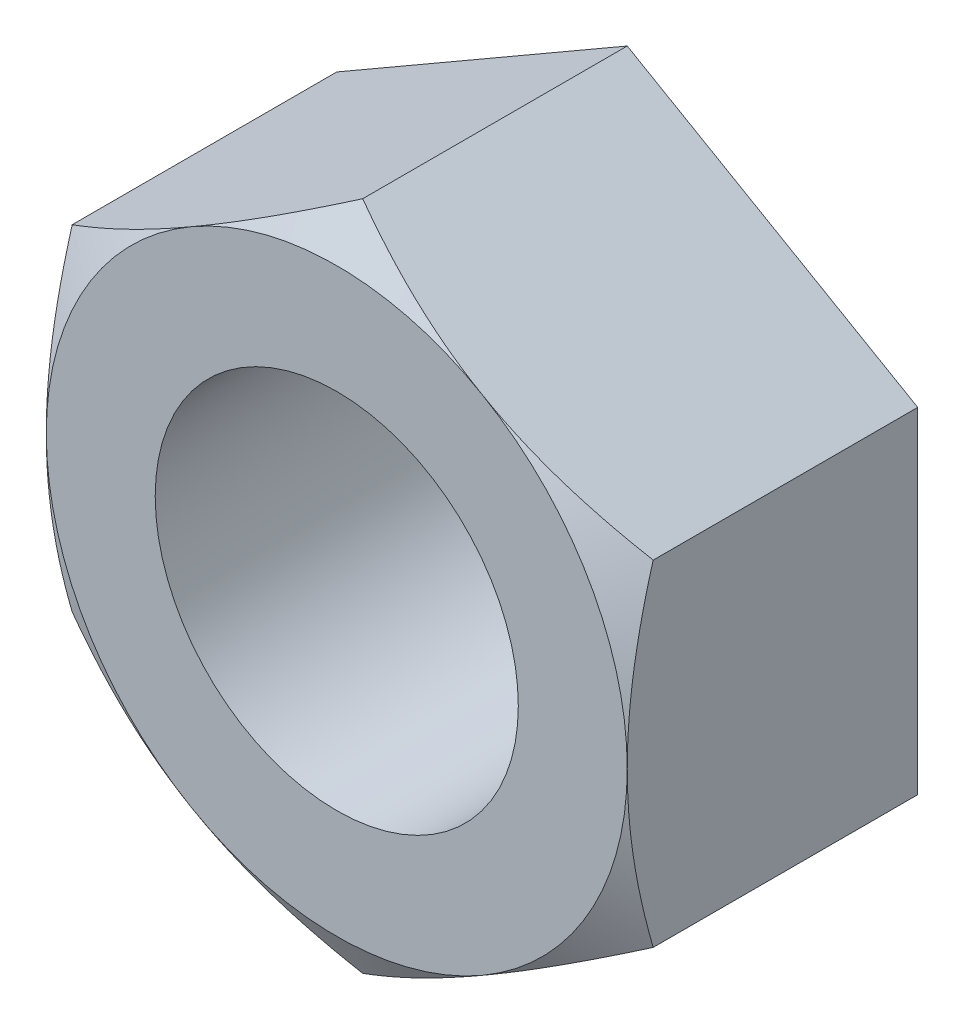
ISO-10303-21;
HEADER;
FILE_DESCRIPTION(('STEP AP214'),'2;1');
FILE_NAME('part.step','',(''),(''),'','','');
FILE_SCHEMA(('AUTOMOTIVE_DESIGN { 1 0 10303 214 1 1 1 1 }'));
ENDSEC;
DATA;
#1=APPLICATION_CONTEXT('core data for automotive mechanical design processes');
#2=APPLICATION_PROTOCOL_DEFINITION('international standard','automotive_design',2000,#1);
#3=PRODUCT_CONTEXT('',#1,'mechanical');
#4=PRODUCT('Part','Part','',(#3));
#5=PRODUCT_RELATED_PRODUCT_CATEGORY('part','',(#4));
#6=PRODUCT_DEFINITION_FORMATION('','',#4);
#7=PRODUCT_DEFINITION_CONTEXT('part definition',#1,'design');
#8=PRODUCT_DEFINITION('design','',#6,#7);
#9=PRODUCT_DEFINITION_SHAPE('','',#8);
#10=(LENGTH_UNIT() NAMED_UNIT(*) SI_UNIT(.MILLI.,.METRE.));
#11=(NAMED_UNIT(*) PLANE_ANGLE_UNIT() SI_UNIT($,.RADIAN.));
#12=(NAMED_UNIT(*) SI_UNIT($,.STERADIAN.) SOLID_ANGLE_UNIT());
#13=UNCERTAINTY_MEASURE_WITH_UNIT(LENGTH_MEASURE(1.E-05),#10,'distance_accuracy_value','');
#14=(GEOMETRIC_REPRESENTATION_CONTEXT(3) GLOBAL_UNCERTAINTY_ASSIGNED_CONTEXT((#13)) GLOBAL_UNIT_ASSIGNED_CONTEXT((#10,
#11,#12)) REPRESENTATION_CONTEXT('',''));
#15=CARTESIAN_POINT('',(0.,0.,0.));
#16=DIRECTION('',(0.,0.,1.));
#17=DIRECTION('',(1.,0.,0.));
#18=AXIS2_PLACEMENT_3D('',#15,#16,#17);
#19=CARTESIAN_POINT('',(4.,2.30940107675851,4.));
#20=DIRECTION('',(-0.5,-0.866025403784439,0.));
#21=DIRECTION('',(0.866025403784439,-0.5,0.));
#22=AXIS2_PLACEMENT_3D('',#19,#20,#21);
#23=PLANE('',#22);
#24=CARTESIAN_POINT('',(4.00000000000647,2.30940107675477,3.64273441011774));
#25=CARTESIAN_POINT('',(3.83720085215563,2.4033932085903,3.6970144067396));
#26=CARTESIAN_POINT('',(3.67309795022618,2.49813806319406,3.74674436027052));
#27=CARTESIAN_POINT('',(3.34344559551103,2.68846293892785,3.83444223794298));
#28=CARTESIAN_POINT('',(3.17790764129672,2.78403632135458,3.87246832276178));
#29=CARTESIAN_POINT('',(2.92803843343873,2.92829837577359,3.91915789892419));
#30=CARTESIAN_POINT('',(2.84443305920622,2.97656796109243,3.93300183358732));
#31=CARTESIAN_POINT('',(2.67682205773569,3.07333821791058,3.95696597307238));
#32=CARTESIAN_POINT('',(2.59281644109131,3.12183888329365,3.96708627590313));
#33=CARTESIAN_POINT('',(2.42409422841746,3.21925069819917,3.98342533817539));
#34=CARTESIAN_POINT('',(2.3393761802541,3.2681626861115,3.98962425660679));
#35=CARTESIAN_POINT('',(2.16977347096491,3.36608285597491,3.99792016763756));
#36=CARTESIAN_POINT('',(2.08488878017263,3.41509105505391,4.00001634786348));
#37=CARTESIAN_POINT('',(2.,3.46410161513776,4.00000000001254));
#38=B_SPLINE_CURVE_WITH_KNOTS('',3,(#24,#25,#26,#27,#28,#29,#30,#31,#32,#33,#34,#35,#36,#37),
.UNSPECIFIED.,.F.,.F.,(4,2,2,2,2,2,4),(0.,0.587229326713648,1.17149154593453,1.46400599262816,
1.75651273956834,2.05048788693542,2.34452123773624),.UNSPECIFIED.);
#39=CARTESIAN_POINT('',(4.,2.30940107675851,3.64273441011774));
#40=VERTEX_POINT('',#39);
#41=CARTESIAN_POINT('',(2.00000000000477,3.46410161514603,4.00000000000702));
#42=VERTEX_POINT('',#41);
#43=EDGE_CURVE('E289',#40,#42,#38,.T.);
#44=ORIENTED_EDGE('',*,*,#43,.F.);
#45=DIRECTION('',(0.,0.,1.));
#46=VECTOR('',#45,1.);
#47=CARTESIAN_POINT('',(4.,2.30940107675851,0.));
#48=LINE('',#47,#46);
#49=CARTESIAN_POINT('',(4.,2.30940107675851,0.));
#50=VERTEX_POINT('',#49);
#51=EDGE_CURVE('E129',#50,#40,#48,.T.);
#52=ORIENTED_EDGE('',*,*,#51,.F.);
#53=DIRECTION('',(0.866025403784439,-0.5,0.));
#54=VECTOR('',#53,1.);
#55=CARTESIAN_POINT('',(4.,2.30940107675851,0.));
#56=LINE('',#55,#54);
#57=CARTESIAN_POINT('',(0.,4.61880215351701,0.));
#58=VERTEX_POINT('',#57);
#59=EDGE_CURVE('E122',#58,#50,#56,.T.);
#60=ORIENTED_EDGE('',*,*,#59,.F.);
#61=DIRECTION('',(0.,0.,1.));
#62=VECTOR('',#61,1.);
#63=CARTESIAN_POINT('',(0.,4.61880215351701,0.));
#64=LINE('',#63,#62);
#65=CARTESIAN_POINT('',(0.,4.61880215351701,3.64273441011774));
#66=VERTEX_POINT('',#65);
#67=EDGE_CURVE('E127',#58,#66,#64,.T.);
#68=ORIENTED_EDGE('',*,*,#67,.T.);
#69=CARTESIAN_POINT('',(2.,3.46410161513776,4.00000000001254));
#70=CARTESIAN_POINT('',(1.91511121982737,3.51311217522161,4.00001634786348));
#71=CARTESIAN_POINT('',(1.8302265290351,3.5621203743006,3.99792016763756));
#72=CARTESIAN_POINT('',(1.6606238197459,3.66004054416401,3.98962425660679));
#73=CARTESIAN_POINT('',(1.57590577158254,3.70895253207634,3.98342533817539));
#74=CARTESIAN_POINT('',(1.40718355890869,3.80636434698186,3.96708627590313));
#75=CARTESIAN_POINT('',(1.32317794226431,3.85486501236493,3.95696597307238));
#76=CARTESIAN_POINT('',(1.15556694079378,3.95163526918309,3.93300183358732));
#77=CARTESIAN_POINT('',(1.07196156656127,3.99990485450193,3.91915789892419));
#78=CARTESIAN_POINT('',(0.822092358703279,4.14416690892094,3.87246832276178));
#79=CARTESIAN_POINT('',(0.656554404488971,4.23974029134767,3.83444223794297));
#80=CARTESIAN_POINT('',(0.326902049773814,4.43006516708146,3.74674436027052));
#81=CARTESIAN_POINT('',(0.16279914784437,4.52481002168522,3.6970144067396));
#82=CARTESIAN_POINT('',(-6.47505238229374E-12,4.61880215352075,3.64273441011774));
#83=B_SPLINE_CURVE_WITH_KNOTS('',3,(#69,#70,#71,#72,#73,#74,#75,#76,#77,#78,#79,#80,#81,#82),
.UNSPECIFIED.,.F.,.F.,(4,2,2,2,2,2,4),(0.,0.294033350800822,0.588008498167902,0.880515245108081,
1.17302969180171,1.75729191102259,2.34452123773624),.UNSPECIFIED.);
#84=EDGE_CURVE('E229',#42,#66,#83,.T.);
#85=ORIENTED_EDGE('',*,*,#84,.F.);
#86=EDGE_LOOP('',(#44,#52,#60,#68,#85));
#87=FACE_BOUND('',#86,.T.);
#88=ADVANCED_FACE('F37',(#87),#23,.F.);
#89=CARTESIAN_POINT('',(4.,-2.3094010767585,4.));
#90=DIRECTION('',(-1.,0.,0.));
#91=DIRECTION('',(0.,0.,1.));
#92=AXIS2_PLACEMENT_3D('',#89,#90,#91);
#93=PLANE('',#92);
#94=CARTESIAN_POINT('',(4.,-2.30940107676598,3.64273441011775));
#95=CARTESIAN_POINT('',(4.,-2.12141681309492,3.6970144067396));
#96=CARTESIAN_POINT('',(4.,-1.9319271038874,3.74674436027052));
#97=CARTESIAN_POINT('',(4.,-1.55127735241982,3.83444223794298));
#98=CARTESIAN_POINT('',(4.,-1.36013058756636,3.87246832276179));
#99=CARTESIAN_POINT('',(4.,-1.07160647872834,3.91915789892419));
#100=CARTESIAN_POINT('',(4.,-0.975067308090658,3.93300183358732));
#101=CARTESIAN_POINT('',(4.,-0.781526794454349,3.95696597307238));
#102=CARTESIAN_POINT('',(4.,-0.684525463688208,3.96708627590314));
#103=CARTESIAN_POINT('',(4.,-0.48970183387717,3.98342533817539));
#104=CARTESIAN_POINT('',(4.,-0.391877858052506,3.9896242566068));
#105=CARTESIAN_POINT('',(4.,-0.19603751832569,3.99792016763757));
#106=CARTESIAN_POINT('',(4.,-0.0980211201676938,4.00001634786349));
#107=CARTESIAN_POINT('',(4.,0.,4.00000000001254));
#108=B_SPLINE_CURVE_WITH_KNOTS('',3,(#94,#95,#96,#97,#98,#99,#100,#101,#102,#103,#104,#105,#106,
#107),.UNSPECIFIED.,.F.,.F.,(4,2,2,2,2,2,4),(0.,0.587229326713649,1.17149154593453,
1.46400599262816,1.75651273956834,2.05048788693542,2.34452123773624),.UNSPECIFIED.);
#109=CARTESIAN_POINT('',(4.,-2.3094010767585,3.64273441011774));
#110=VERTEX_POINT('',#109);
#111=CARTESIAN_POINT('',(4.00000000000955,0.,4.00000000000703));
#112=VERTEX_POINT('',#111);
#113=EDGE_CURVE('E326',#110,#112,#108,.T.);
#114=ORIENTED_EDGE('',*,*,#113,.F.);
#115=DIRECTION('',(0.,0.,1.));
#116=VECTOR('',#115,1.);
#117=CARTESIAN_POINT('',(4.,-2.3094010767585,0.));
#118=LINE('',#117,#116);
#119=CARTESIAN_POINT('',(4.,-2.3094010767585,0.));
#120=VERTEX_POINT('',#119);
#121=EDGE_CURVE('E150',#120,#110,#118,.T.);
#122=ORIENTED_EDGE('',*,*,#121,.F.);
#123=DIRECTION('',(0.,-1.,0.));
#124=VECTOR('',#123,1.);
#125=CARTESIAN_POINT('',(4.,-2.3094010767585,0.));
#126=LINE('',#125,#124);
#127=EDGE_CURVE('E132',#50,#120,#126,.T.);
#128=ORIENTED_EDGE('',*,*,#127,.F.);
#129=ORIENTED_EDGE('',*,*,#51,.T.);
#130=CARTESIAN_POINT('',(4.,0.,4.00000000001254));
#131=CARTESIAN_POINT('',(4.,0.0980211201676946,4.00001634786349));
#132=CARTESIAN_POINT('',(4.,0.196037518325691,3.99792016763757));
#133=CARTESIAN_POINT('',(4.,0.391877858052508,3.9896242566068));
#134=CARTESIAN_POINT('',(4.,0.489701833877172,3.98342533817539));
#135=CARTESIAN_POINT('',(4.,0.684525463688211,3.96708627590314));
#136=CARTESIAN_POINT('',(4.,0.781526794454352,3.95696597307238));
#137=CARTESIAN_POINT('',(4.,0.975067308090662,3.93300183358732));
#138=CARTESIAN_POINT('',(4.,1.07160647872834,3.91915789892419));
#139=CARTESIAN_POINT('',(4.,1.36013058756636,3.87246832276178));
#140=CARTESIAN_POINT('',(4.,1.55127735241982,3.83444223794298));
#141=CARTESIAN_POINT('',(4.,1.9319271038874,3.74674436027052));
#142=CARTESIAN_POINT('',(4.,2.12141681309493,3.6970144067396));
#143=CARTESIAN_POINT('',(4.,2.30940107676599,3.64273441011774));
#144=B_SPLINE_CURVE_WITH_KNOTS('',3,(#130,#131,#132,#133,#134,#135,#136,#137,#138,#139,#140,
#141,#142,#143),.UNSPECIFIED.,.F.,.F.,(4,2,2,2,2,2,4),(0.,0.294033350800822,0.588008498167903,
0.880515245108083,1.17302969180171,1.7572919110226,2.34452123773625),.UNSPECIFIED.);
#145=EDGE_CURVE('E307',#112,#40,#144,.T.);
#146=ORIENTED_EDGE('',*,*,#145,.F.);
#147=EDGE_LOOP('',(#114,#122,#128,#129,#146));
#148=FACE_BOUND('',#147,.T.);
#149=ADVANCED_FACE('F311',(#148),#93,.F.);
#150=CARTESIAN_POINT('',(0.,-4.618802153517,4.));
#151=DIRECTION('',(-0.5,0.866025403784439,0.));
#152=DIRECTION('',(-0.866025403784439,-0.5,0.));
#153=AXIS2_PLACEMENT_3D('',#150,#151,#152);
#154=PLANE('',#153);
#155=CARTESIAN_POINT('',(-6.47531300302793E-12,-4.61880215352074,3.64273441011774));
#156=CARTESIAN_POINT('',(0.162799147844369,-4.52481002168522,3.6970144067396));
#157=CARTESIAN_POINT('',(0.326902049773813,-4.43006516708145,3.74674436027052));
#158=CARTESIAN_POINT('',(0.656554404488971,-4.23974029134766,3.83444223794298));
#159=CARTESIAN_POINT('',(0.822092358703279,-4.14416690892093,3.87246832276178));
#160=CARTESIAN_POINT('',(1.07196156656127,-3.99990485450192,3.91915789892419));
#161=CARTESIAN_POINT('',(1.15556694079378,-3.95163526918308,3.93300183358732));
#162=CARTESIAN_POINT('',(1.32317794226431,-3.85486501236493,3.95696597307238));
#163=CARTESIAN_POINT('',(1.40718355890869,-3.80636434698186,3.96708627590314));
#164=CARTESIAN_POINT('',(1.57590577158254,-3.70895253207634,3.98342533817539));
#165=CARTESIAN_POINT('',(1.6606238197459,-3.66004054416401,3.9896242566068));
#166=CARTESIAN_POINT('',(1.8302265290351,-3.5621203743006,3.99792016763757));
#167=CARTESIAN_POINT('',(1.91511121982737,-3.5131121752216,4.00001634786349));
#168=CARTESIAN_POINT('',(2.,-3.46410161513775,4.00000000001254));
#169=B_SPLINE_CURVE_WITH_KNOTS('',3,(#155,#156,#157,#158,#159,#160,#161,#162,#163,#164,#165,
#166,#167,#168),.UNSPECIFIED.,.F.,.F.,(4,2,2,2,2,2,4),(0.,0.58722932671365,1.17149154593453,
1.46400599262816,1.75651273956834,2.05048788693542,2.34452123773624),.UNSPECIFIED.);
#170=CARTESIAN_POINT('',(0.,-4.618802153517,3.64273441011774));
#171=VERTEX_POINT('',#170);
#172=CARTESIAN_POINT('',(2.00000000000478,-3.46410161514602,4.00000000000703));
#173=VERTEX_POINT('',#172);
#174=EDGE_CURVE('E522',#171,#173,#169,.T.);
#175=ORIENTED_EDGE('',*,*,#174,.F.);
#176=DIRECTION('',(0.,0.,1.));
#177=VECTOR('',#176,1.);
#178=CARTESIAN_POINT('',(0.,-4.618802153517,0.));
#179=LINE('',#178,#177);
#180=CARTESIAN_POINT('',(0.,-4.618802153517,0.));
#181=VERTEX_POINT('',#180);
#182=EDGE_CURVE('E159',#181,#171,#179,.T.);
#183=ORIENTED_EDGE('',*,*,#182,.F.);
#184=DIRECTION('',(-0.866025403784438,-0.5,0.));
#185=VECTOR('',#184,1.);
#186=CARTESIAN_POINT('',(0.,-4.618802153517,0.));
#187=LINE('',#186,#185);
#188=EDGE_CURVE('E342',#120,#181,#187,.T.);
#189=ORIENTED_EDGE('',*,*,#188,.F.);
#190=ORIENTED_EDGE('',*,*,#121,.T.);
#191=CARTESIAN_POINT('',(2.,-3.46410161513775,4.00000000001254));
#192=CARTESIAN_POINT('',(2.08488878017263,-3.4150910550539,4.00001634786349));
#193=CARTESIAN_POINT('',(2.16977347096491,-3.36608285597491,3.99792016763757));
#194=CARTESIAN_POINT('',(2.3393761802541,-3.2681626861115,3.9896242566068));
#195=CARTESIAN_POINT('',(2.42409422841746,-3.21925069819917,3.98342533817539));
#196=CARTESIAN_POINT('',(2.59281644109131,-3.12183888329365,3.96708627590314));
#197=CARTESIAN_POINT('',(2.67682205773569,-3.07333821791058,3.95696597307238));
#198=CARTESIAN_POINT('',(2.84443305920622,-2.97656796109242,3.93300183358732));
#199=CARTESIAN_POINT('',(2.92803843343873,-2.92829837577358,3.91915789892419));
#200=CARTESIAN_POINT('',(3.17790764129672,-2.78403632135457,3.87246832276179));
#201=CARTESIAN_POINT('',(3.34344559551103,-2.68846293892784,3.83444223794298));
#202=CARTESIAN_POINT('',(3.67309795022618,-2.49813806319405,3.74674436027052));
#203=CARTESIAN_POINT('',(3.83720085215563,-2.40339320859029,3.6970144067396));
#204=CARTESIAN_POINT('',(4.00000000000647,-2.30940107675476,3.64273441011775));
#205=B_SPLINE_CURVE_WITH_KNOTS('',3,(#191,#192,#193,#194,#195,#196,#197,#198,#199,#200,#201,
#202,#203,#204),.UNSPECIFIED.,.F.,.F.,(4,2,2,2,2,2,4),(0.,0.294033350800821,0.588008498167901,
0.88051524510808,1.17302969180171,1.75729191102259,2.34452123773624),.UNSPECIFIED.);
#206=EDGE_CURVE('E291',#173,#110,#205,.T.);
#207=ORIENTED_EDGE('',*,*,#206,.F.);
#208=EDGE_LOOP('',(#175,#183,#189,#190,#207));
#209=FACE_BOUND('',#208,.T.);
#210=ADVANCED_FACE('F314',(#209),#154,.F.);
#211=CARTESIAN_POINT('',(-4.,-2.3094010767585,4.));
#212=DIRECTION('',(0.5,0.866025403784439,0.));
#213=DIRECTION('',(-0.866025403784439,0.5,0.));
#214=AXIS2_PLACEMENT_3D('',#211,#212,#213);
#215=PLANE('',#214);
#216=CARTESIAN_POINT('',(-4.00000000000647,-2.30940107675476,3.64273441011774));
#217=CARTESIAN_POINT('',(-3.83720085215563,-2.40339320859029,3.6970144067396));
#218=CARTESIAN_POINT('',(-3.67309795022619,-2.49813806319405,3.74674436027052));
#219=CARTESIAN_POINT('',(-3.34344559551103,-2.68846293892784,3.83444223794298));
#220=CARTESIAN_POINT('',(-3.17790764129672,-2.78403632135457,3.87246832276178));
#221=CARTESIAN_POINT('',(-2.92803843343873,-2.92829837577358,3.91915789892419));
#222=CARTESIAN_POINT('',(-2.84443305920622,-2.97656796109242,3.93300183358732));
#223=CARTESIAN_POINT('',(-2.67682205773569,-3.07333821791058,3.95696597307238));
#224=CARTESIAN_POINT('',(-2.59281644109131,-3.12183888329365,3.96708627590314));
#225=CARTESIAN_POINT('',(-2.42409422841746,-3.21925069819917,3.98342533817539));
#226=CARTESIAN_POINT('',(-2.3393761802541,-3.2681626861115,3.9896242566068));
#227=CARTESIAN_POINT('',(-2.1697734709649,-3.36608285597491,3.99792016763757));
#228=CARTESIAN_POINT('',(-2.08488878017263,-3.41509105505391,4.00001634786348));
#229=CARTESIAN_POINT('',(-2.,-3.46410161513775,4.00000000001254));
#230=B_SPLINE_CURVE_WITH_KNOTS('',3,(#216,#217,#218,#219,#220,#221,#222,#223,#224,#225,#226,
#227,#228,#229),.UNSPECIFIED.,.F.,.F.,(4,2,2,2,2,2,4),(0.,0.58722932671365,1.17149154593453,
1.46400599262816,1.75651273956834,2.05048788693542,2.34452123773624),.UNSPECIFIED.);
#231=CARTESIAN_POINT('',(-4.,-2.3094010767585,3.64273441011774));
#232=VERTEX_POINT('',#231);
#233=CARTESIAN_POINT('',(-2.00000000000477,-3.46410161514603,4.00000000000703));
#234=VERTEX_POINT('',#233);
#235=EDGE_CURVE('E181',#232,#234,#230,.T.);
#236=ORIENTED_EDGE('',*,*,#235,.F.);
#237=DIRECTION('',(0.,0.,1.));
#238=VECTOR('',#237,1.);
#239=CARTESIAN_POINT('',(-4.,-2.3094010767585,0.));
#240=LINE('',#239,#238);
#241=CARTESIAN_POINT('',(-4.,-2.3094010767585,0.));
#242=VERTEX_POINT('',#241);
#243=EDGE_CURVE('E164',#242,#232,#240,.T.);
#244=ORIENTED_EDGE('',*,*,#243,.F.);
#245=DIRECTION('',(-0.866025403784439,0.5,0.));
#246=VECTOR('',#245,1.);
#247=CARTESIAN_POINT('',(-4.,-2.3094010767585,0.));
#248=LINE('',#247,#246);
#249=EDGE_CURVE('E340',#181,#242,#248,.T.);
#250=ORIENTED_EDGE('',*,*,#249,.F.);
#251=ORIENTED_EDGE('',*,*,#182,.T.);
#252=CARTESIAN_POINT('',(-2.,-3.46410161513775,4.00000000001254));
#253=CARTESIAN_POINT('',(-1.91511121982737,-3.5131121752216,4.00001634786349));
#254=CARTESIAN_POINT('',(-1.83022652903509,-3.5621203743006,3.99792016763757));
#255=CARTESIAN_POINT('',(-1.6606238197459,-3.66004054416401,3.9896242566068));
#256=CARTESIAN_POINT('',(-1.57590577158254,-3.70895253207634,3.98342533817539));
#257=CARTESIAN_POINT('',(-1.40718355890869,-3.80636434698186,3.96708627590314));
#258=CARTESIAN_POINT('',(-1.32317794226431,-3.85486501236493,3.95696597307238));
#259=CARTESIAN_POINT('',(-1.15556694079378,-3.95163526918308,3.93300183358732));
#260=CARTESIAN_POINT('',(-1.07196156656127,-3.99990485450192,3.91915789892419));
#261=CARTESIAN_POINT('',(-0.822092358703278,-4.14416690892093,3.87246832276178));
#262=CARTESIAN_POINT('',(-0.65655440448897,-4.23974029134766,3.83444223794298));
#263=CARTESIAN_POINT('',(-0.326902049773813,-4.43006516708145,3.74674436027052));
#264=CARTESIAN_POINT('',(-0.162799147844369,-4.52481002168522,3.6970144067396));
#265=CARTESIAN_POINT('',(6.47543648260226E-12,-4.61880215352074,3.64273441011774));
#266=B_SPLINE_CURVE_WITH_KNOTS('',3,(#252,#253,#254,#255,#256,#257,#258,#259,#260,#261,#262,
#263,#264,#265),.UNSPECIFIED.,.F.,.F.,(4,2,2,2,2,2,4),(0.,0.294033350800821,0.588008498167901,
0.88051524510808,1.17302969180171,1.75729191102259,2.34452123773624),.UNSPECIFIED.);
#267=EDGE_CURVE('E88',#234,#171,#266,.T.);
#268=ORIENTED_EDGE('',*,*,#267,.F.);
#269=EDGE_LOOP('',(#236,#244,#250,#251,#268));
#270=FACE_BOUND('',#269,.T.);
#271=ADVANCED_FACE('F185',(#270),#215,.F.);
#272=CARTESIAN_POINT('',(-4.,2.3094010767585,4.));
#273=DIRECTION('',(1.,0.,0.));
#274=DIRECTION('',(0.,1.,0.));
#275=AXIS2_PLACEMENT_3D('',#272,#273,#274);
#276=PLANE('',#275);
#277=CARTESIAN_POINT('',(-4.,2.30940107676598,3.64273441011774));
#278=CARTESIAN_POINT('',(-4.,2.12141681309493,3.6970144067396));
#279=CARTESIAN_POINT('',(-4.,1.9319271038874,3.74674436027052));
#280=CARTESIAN_POINT('',(-4.,1.55127735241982,3.83444223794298));
#281=CARTESIAN_POINT('',(-4.,1.36013058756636,3.87246832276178));
#282=CARTESIAN_POINT('',(-4.,1.07160647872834,3.91915789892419));
#283=CARTESIAN_POINT('',(-4.,0.97506730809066,3.93300183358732));
#284=CARTESIAN_POINT('',(-4.,0.78152679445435,3.95696597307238));
#285=CARTESIAN_POINT('',(-4.,0.684525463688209,3.96708627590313));
#286=CARTESIAN_POINT('',(-4.,0.489701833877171,3.98342533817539));
#287=CARTESIAN_POINT('',(-4.,0.391877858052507,3.9896242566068));
#288=CARTESIAN_POINT('',(-4.,0.19603751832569,3.99792016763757));
#289=CARTESIAN_POINT('',(-4.,0.0980211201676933,4.00001634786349));
#290=CARTESIAN_POINT('',(-4.,0.,4.00000000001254));
#291=B_SPLINE_CURVE_WITH_KNOTS('',3,(#277,#278,#279,#280,#281,#282,#283,#284,#285,#286,#287,
#288,#289,#290),.UNSPECIFIED.,.F.,.F.,(4,2,2,2,2,2,4),(0.,0.58722932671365,1.17149154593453,
1.46400599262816,1.75651273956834,2.05048788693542,2.34452123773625),.UNSPECIFIED.);
#292=CARTESIAN_POINT('',(-4.,2.3094010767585,3.64273441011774));
#293=VERTEX_POINT('',#292);
#294=CARTESIAN_POINT('',(-4.00000000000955,0.,4.00000000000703));
#295=VERTEX_POINT('',#294);
#296=EDGE_CURVE('E227',#293,#295,#291,.T.);
#297=ORIENTED_EDGE('',*,*,#296,.F.);
#298=DIRECTION('',(0.,0.,1.));
#299=VECTOR('',#298,1.);
#300=CARTESIAN_POINT('',(-4.,2.3094010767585,0.));
#301=LINE('',#300,#299);
#302=CARTESIAN_POINT('',(-4.,2.3094010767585,0.));
#303=VERTEX_POINT('',#302);
#304=EDGE_CURVE('E169',#303,#293,#301,.T.);
#305=ORIENTED_EDGE('',*,*,#304,.F.);
#306=DIRECTION('',(0.,1.,0.));
#307=VECTOR('',#306,1.);
#308=CARTESIAN_POINT('',(-4.,2.3094010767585,0.));
#309=LINE('',#308,#307);
#310=EDGE_CURVE('E138',#242,#303,#309,.T.);
#311=ORIENTED_EDGE('',*,*,#310,.F.);
#312=ORIENTED_EDGE('',*,*,#243,.T.);
#313=CARTESIAN_POINT('',(-4.,0.,4.00000000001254));
#314=CARTESIAN_POINT('',(-4.,-0.0980211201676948,4.00001634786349));
#315=CARTESIAN_POINT('',(-4.,-0.196037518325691,3.99792016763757));
#316=CARTESIAN_POINT('',(-4.,-0.391877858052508,3.9896242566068));
#317=CARTESIAN_POINT('',(-4.,-0.489701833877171,3.98342533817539));
#318=CARTESIAN_POINT('',(-4.,-0.684525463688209,3.96708627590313));
#319=CARTESIAN_POINT('',(-4.,-0.78152679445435,3.95696597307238));
#320=CARTESIAN_POINT('',(-4.,-0.975067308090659,3.93300183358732));
#321=CARTESIAN_POINT('',(-4.,-1.07160647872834,3.91915789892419));
#322=CARTESIAN_POINT('',(-4.,-1.36013058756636,3.87246832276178));
#323=CARTESIAN_POINT('',(-4.,-1.55127735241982,3.83444223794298));
#324=CARTESIAN_POINT('',(-4.,-1.9319271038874,3.74674436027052));
#325=CARTESIAN_POINT('',(-4.,-2.12141681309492,3.6970144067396));
#326=CARTESIAN_POINT('',(-4.,-2.30940107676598,3.64273441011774));
#327=B_SPLINE_CURVE_WITH_KNOTS('',3,(#313,#314,#315,#316,#317,#318,#319,#320,#321,#322,#323,
#324,#325,#326),.UNSPECIFIED.,.F.,.F.,(4,2,2,2,2,2,4),(0.,0.294033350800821,0.588008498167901,
0.88051524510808,1.17302969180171,1.75729191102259,2.34452123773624),.UNSPECIFIED.);
#328=EDGE_CURVE('E80',#295,#232,#327,.T.);
#329=ORIENTED_EDGE('',*,*,#328,.F.);
#330=EDGE_LOOP('',(#297,#305,#311,#312,#329));
#331=FACE_BOUND('',#330,.T.);
#332=ADVANCED_FACE('F211',(#331),#276,.F.);
#333=CARTESIAN_POINT('',(0.,4.61880215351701,4.));
#334=DIRECTION('',(0.5,-0.866025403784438,0.));
#335=DIRECTION('',(0.866025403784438,0.5,0.));
#336=AXIS2_PLACEMENT_3D('',#333,#334,#335);
#337=PLANE('',#336);
#338=CARTESIAN_POINT('',(6.47483170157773E-12,4.61880215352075,3.64273441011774));
#339=CARTESIAN_POINT('',(-0.16279914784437,4.52481002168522,3.6970144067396));
#340=CARTESIAN_POINT('',(-0.326902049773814,4.43006516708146,3.74674436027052));
#341=CARTESIAN_POINT('',(-0.656554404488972,4.23974029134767,3.83444223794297));
#342=CARTESIAN_POINT('',(-0.82209235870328,4.14416690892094,3.87246832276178));
#343=CARTESIAN_POINT('',(-1.07196156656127,3.99990485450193,3.91915789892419));
#344=CARTESIAN_POINT('',(-1.15556694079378,3.95163526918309,3.93300183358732));
#345=CARTESIAN_POINT('',(-1.32317794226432,3.85486501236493,3.95696597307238));
#346=CARTESIAN_POINT('',(-1.40718355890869,3.80636434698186,3.96708627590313));
#347=CARTESIAN_POINT('',(-1.57590577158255,3.70895253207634,3.98342533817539));
#348=CARTESIAN_POINT('',(-1.6606238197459,3.66004054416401,3.9896242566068));
#349=CARTESIAN_POINT('',(-1.8302265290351,3.5621203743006,3.99792016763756));
#350=CARTESIAN_POINT('',(-1.91511121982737,3.5131121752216,4.00001634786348));
#351=CARTESIAN_POINT('',(-2.,3.46410161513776,4.00000000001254));
#352=B_SPLINE_CURVE_WITH_KNOTS('',3,(#338,#339,#340,#341,#342,#343,#344,#345,#346,#347,#348,
#349,#350,#351),.UNSPECIFIED.,.F.,.F.,(4,2,2,2,2,2,4),(0.,0.587229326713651,1.17149154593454,
1.46400599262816,1.75651273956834,2.05048788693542,2.34452123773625),.UNSPECIFIED.);
#353=CARTESIAN_POINT('',(-2.00000000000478,3.46410161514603,4.00000000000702));
#354=VERTEX_POINT('',#353);
#355=EDGE_CURVE('E48',#66,#354,#352,.T.);
#356=ORIENTED_EDGE('',*,*,#355,.F.);
#357=ORIENTED_EDGE('',*,*,#67,.F.);
#358=DIRECTION('',(0.866025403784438,0.5,0.));
#359=VECTOR('',#358,1.);
#360=CARTESIAN_POINT('',(0.,4.61880215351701,0.));
#361=LINE('',#360,#359);
#362=EDGE_CURVE('E133',#303,#58,#361,.T.);
#363=ORIENTED_EDGE('',*,*,#362,.F.);
#364=ORIENTED_EDGE('',*,*,#304,.T.);
#365=CARTESIAN_POINT('',(-2.,3.46410161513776,4.00000000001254));
#366=CARTESIAN_POINT('',(-2.08488878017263,3.41509105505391,4.00001634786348));
#367=CARTESIAN_POINT('',(-2.16977347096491,3.36608285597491,3.99792016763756));
#368=CARTESIAN_POINT('',(-2.33937618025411,3.2681626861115,3.98962425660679));
#369=CARTESIAN_POINT('',(-2.42409422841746,3.21925069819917,3.98342533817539));
#370=CARTESIAN_POINT('',(-2.59281644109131,3.12183888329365,3.96708627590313));
#371=CARTESIAN_POINT('',(-2.67682205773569,3.07333821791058,3.95696597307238));
#372=CARTESIAN_POINT('',(-2.84443305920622,2.97656796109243,3.93300183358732));
#373=CARTESIAN_POINT('',(-2.92803843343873,2.92829837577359,3.91915789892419));
#374=CARTESIAN_POINT('',(-3.17790764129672,2.78403632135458,3.87246832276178));
#375=CARTESIAN_POINT('',(-3.34344559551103,2.68846293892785,3.83444223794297));
#376=CARTESIAN_POINT('',(-3.67309795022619,2.49813806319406,3.74674436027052));
#377=CARTESIAN_POINT('',(-3.83720085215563,2.40339320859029,3.6970144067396));
#378=CARTESIAN_POINT('',(-4.00000000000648,2.30940107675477,3.64273441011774));
#379=B_SPLINE_CURVE_WITH_KNOTS('',3,(#365,#366,#367,#368,#369,#370,#371,#372,#373,#374,#375,
#376,#377,#378),.UNSPECIFIED.,.F.,.F.,(4,2,2,2,2,2,4),(0.,0.294033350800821,0.588008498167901,
0.88051524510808,1.17302969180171,1.75729191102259,2.34452123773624),.UNSPECIFIED.);
#380=EDGE_CURVE('E12',#354,#293,#379,.T.);
#381=ORIENTED_EDGE('',*,*,#380,.F.);
#382=EDGE_LOOP('',(#356,#357,#363,#364,#381));
#383=FACE_BOUND('',#382,.T.);
#384=ADVANCED_FACE('F145',(#383),#337,.F.);
#385=CARTESIAN_POINT('',(4.,2.30940107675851,4.));
#386=DIRECTION('',(0.,0.,-1.));
#387=DIRECTION('',(-1.,0.,0.));
#388=AXIS2_PLACEMENT_3D('',#385,#386,#387);
#389=PLANE('',#388);
#390=CARTESIAN_POINT('',(0.,0.,4.));
#391=DIRECTION('',(0.,0.,-1.));
#392=DIRECTION('',(-1.,0.,0.));
#393=AXIS2_PLACEMENT_3D('',#390,#391,#392);
#394=CIRCLE('',#393,2.49999999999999);
#395=CARTESIAN_POINT('',(-2.49999999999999,0.,4.));
#396=VERTEX_POINT('',#395);
#397=EDGE_CURVE('E142',#396,#396,#394,.T.);
#398=ORIENTED_EDGE('',*,*,#397,.T.);
#399=EDGE_LOOP('',(#398));
#400=FACE_BOUND('',#399,.T.);
#401=CARTESIAN_POINT('',(0.,0.,4.00000000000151));
#402=DIRECTION('',(0.,0.,-1.));
#403=DIRECTION('',(0.,1.,0.));
#404=AXIS2_PLACEMENT_3D('',#401,#402,#403);
#405=CIRCLE('',#404,4.0000000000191);
#406=EDGE_CURVE('E259',#234,#295,#405,.T.);
#407=ORIENTED_EDGE('',*,*,#406,.F.);
#408=CARTESIAN_POINT('',(0.,0.,4.00000000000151));
#409=DIRECTION('',(0.,0.,-1.));
#410=DIRECTION('',(0.,1.,0.));
#411=AXIS2_PLACEMENT_3D('',#408,#409,#410);
#412=CIRCLE('',#411,4.0000000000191);
#413=EDGE_CURVE('E263',#173,#234,#412,.T.);
#414=ORIENTED_EDGE('',*,*,#413,.F.);
#415=CARTESIAN_POINT('',(0.,0.,4.00000000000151));
#416=DIRECTION('',(0.,0.,-1.));
#417=DIRECTION('',(0.,1.,0.));
#418=AXIS2_PLACEMENT_3D('',#415,#416,#417);
#419=CIRCLE('',#418,4.0000000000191);
#420=EDGE_CURVE('E148',#112,#173,#419,.T.);
#421=ORIENTED_EDGE('',*,*,#420,.F.);
#422=CARTESIAN_POINT('',(0.,0.,4.00000000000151));
#423=DIRECTION('',(0.,0.,-1.));
#424=DIRECTION('',(0.,1.,0.));
#425=AXIS2_PLACEMENT_3D('',#422,#423,#424);
#426=CIRCLE('',#425,4.0000000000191);
#427=EDGE_CURVE('E72',#42,#112,#426,.T.);
#428=ORIENTED_EDGE('',*,*,#427,.F.);
#429=CARTESIAN_POINT('',(0.,0.,4.00000000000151));
#430=DIRECTION('',(0.,0.,-1.));
#431=DIRECTION('',(0.,1.,0.));
#432=AXIS2_PLACEMENT_3D('',#429,#430,#431);
#433=CIRCLE('',#432,4.0000000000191);
#434=EDGE_CURVE('E57',#354,#42,#433,.T.);
#435=ORIENTED_EDGE('',*,*,#434,.F.);
#436=CARTESIAN_POINT('',(0.,0.,4.00000000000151));
#437=DIRECTION('',(0.,0.,-1.));
#438=DIRECTION('',(0.,1.,0.));
#439=AXIS2_PLACEMENT_3D('',#436,#437,#438);
#440=CIRCLE('',#439,4.0000000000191);
#441=EDGE_CURVE('E334',#295,#354,#440,.T.);
#442=ORIENTED_EDGE('',*,*,#441,.F.);
#443=EDGE_LOOP('',(#407,#414,#421,#428,#435,#442));
#444=FACE_BOUND('',#443,.T.);
#445=ADVANCED_FACE('F39',(#400,#444),#389,.F.);
#446=CARTESIAN_POINT('',(0.,0.,3.64059081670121));
#447=DIRECTION('',(0.,0.,-1.));
#448=DIRECTION('',(0.,1.,0.));
#449=AXIS2_PLACEMENT_3D('',#446,#447,#448);
#450=CONICAL_SURFACE('',#449,4.62251496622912,1.04719755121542);
#451=ORIENTED_EDGE('',*,*,#145,.T.);
#452=ORIENTED_EDGE('',*,*,#43,.T.);
#453=ORIENTED_EDGE('',*,*,#427,.T.);
#454=EDGE_LOOP('',(#451,#452,#453));
#455=FACE_BOUND('',#454,.T.);
#456=ADVANCED_FACE('F294',(#455),#450,.T.);
#457=CARTESIAN_POINT('',(0.,0.,3.64059081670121));
#458=DIRECTION('',(0.,0.,-1.));
#459=DIRECTION('',(0.,1.,0.));
#460=AXIS2_PLACEMENT_3D('',#457,#458,#459);
#461=CONICAL_SURFACE('',#460,4.62251496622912,1.04719755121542);
#462=ORIENTED_EDGE('',*,*,#420,.T.);
#463=ORIENTED_EDGE('',*,*,#206,.T.);
#464=ORIENTED_EDGE('',*,*,#113,.T.);
#465=EDGE_LOOP('',(#462,#463,#464));
#466=FACE_BOUND('',#465,.T.);
#467=ADVANCED_FACE('F297',(#466),#461,.T.);
#468=CARTESIAN_POINT('',(0.,0.,3.64059081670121));
#469=DIRECTION('',(0.,0.,-1.));
#470=DIRECTION('',(0.,1.,0.));
#471=AXIS2_PLACEMENT_3D('',#468,#469,#470);
#472=CONICAL_SURFACE('',#471,4.62251496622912,1.04719755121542);
#473=ORIENTED_EDGE('',*,*,#413,.T.);
#474=ORIENTED_EDGE('',*,*,#267,.T.);
#475=ORIENTED_EDGE('',*,*,#174,.T.);
#476=EDGE_LOOP('',(#473,#474,#475));
#477=FACE_BOUND('',#476,.T.);
#478=ADVANCED_FACE('F195',(#477),#472,.T.);
#479=CARTESIAN_POINT('',(0.,0.,3.64059081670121));
#480=DIRECTION('',(0.,0.,-1.));
#481=DIRECTION('',(0.,1.,0.));
#482=AXIS2_PLACEMENT_3D('',#479,#480,#481);
#483=CONICAL_SURFACE('',#482,4.62251496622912,1.04719755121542);
#484=ORIENTED_EDGE('',*,*,#406,.T.);
#485=ORIENTED_EDGE('',*,*,#328,.T.);
#486=ORIENTED_EDGE('',*,*,#235,.T.);
#487=EDGE_LOOP('',(#484,#485,#486));
#488=FACE_BOUND('',#487,.T.);
#489=ADVANCED_FACE('F189',(#488),#483,.T.);
#490=CARTESIAN_POINT('',(0.,0.,3.64059081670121));
#491=DIRECTION('',(0.,0.,-1.));
#492=DIRECTION('',(0.,1.,0.));
#493=AXIS2_PLACEMENT_3D('',#490,#491,#492);
#494=CONICAL_SURFACE('',#493,4.62251496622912,1.04719755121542);
#495=ORIENTED_EDGE('',*,*,#84,.T.);
#496=ORIENTED_EDGE('',*,*,#355,.T.);
#497=ORIENTED_EDGE('',*,*,#434,.T.);
#498=EDGE_LOOP('',(#495,#496,#497));
#499=FACE_BOUND('',#498,.T.);
#500=ADVANCED_FACE('F194',(#499),#494,.T.);
#501=CARTESIAN_POINT('',(0.,0.,3.64059081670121));
#502=DIRECTION('',(0.,0.,-1.));
#503=DIRECTION('',(0.,1.,0.));
#504=AXIS2_PLACEMENT_3D('',#501,#502,#503);
#505=CONICAL_SURFACE('',#504,4.62251496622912,1.04719755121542);
#506=ORIENTED_EDGE('',*,*,#380,.T.);
#507=ORIENTED_EDGE('',*,*,#296,.T.);
#508=ORIENTED_EDGE('',*,*,#441,.T.);
#509=EDGE_LOOP('',(#506,#507,#508));
#510=FACE_BOUND('',#509,.T.);
#511=ADVANCED_FACE('F233',(#510),#505,.T.);
#512=CARTESIAN_POINT('',(0.,0.,0.));
#513=DIRECTION('',(0.,0.,1.));
#514=DIRECTION('',(1.,0.,0.));
#515=AXIS2_PLACEMENT_3D('',#512,#513,#514);
#516=PLANE('',#515);
#517=CARTESIAN_POINT('',(0.,0.,0.));
#518=DIRECTION('',(0.,0.,-1.));
#519=DIRECTION('',(-1.,0.,0.));
#520=AXIS2_PLACEMENT_3D('',#517,#518,#519);
#521=CIRCLE('',#520,2.49999999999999);
#522=CARTESIAN_POINT('',(-2.49999999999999,0.,0.));
#523=VERTEX_POINT('',#522);
#524=EDGE_CURVE('E347',#523,#523,#521,.T.);
#525=ORIENTED_EDGE('',*,*,#524,.F.);
#526=EDGE_LOOP('',(#525));
#527=FACE_BOUND('',#526,.T.);
#528=ORIENTED_EDGE('',*,*,#362,.T.);
#529=ORIENTED_EDGE('',*,*,#59,.T.);
#530=ORIENTED_EDGE('',*,*,#127,.T.);
#531=ORIENTED_EDGE('',*,*,#188,.T.);
#532=ORIENTED_EDGE('',*,*,#249,.T.);
#533=ORIENTED_EDGE('',*,*,#310,.T.);
#534=EDGE_LOOP('',(#528,#529,#530,#531,#532,#533));
#535=FACE_BOUND('',#534,.T.);
#536=ADVANCED_FACE('F136',(#527,#535),#516,.F.);
#537=CARTESIAN_POINT('',(0.,0.,0.));
#538=DIRECTION('',(0.,0.,-1.));
#539=DIRECTION('',(-1.,0.,0.));
#540=AXIS2_PLACEMENT_3D('',#537,#538,#539);
#541=CYLINDRICAL_SURFACE('',#540,2.49999999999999);
#542=ORIENTED_EDGE('',*,*,#524,.T.);
#543=EDGE_LOOP('',(#542));
#544=FACE_BOUND('',#543,.T.);
#545=ORIENTED_EDGE('',*,*,#397,.F.);
#546=EDGE_LOOP('',(#545));
#547=FACE_BOUND('',#546,.T.);
#548=ADVANCED_FACE('F351',(#544,#547),#541,.F.);
#549=CLOSED_SHELL('',(#88,#149,#210,#271,#332,#384,#445,#456,#467,#478,#489,#500,#511,#536,#548));
#550=MANIFOLD_SOLID_BREP('B2',#549);
#551=ADVANCED_BREP_SHAPE_REPRESENTATION('',(#18,#550),#14);
#552=SHAPE_DEFINITION_REPRESENTATION(#9,#551);
ENDSEC;
END-ISO-10303-21;
